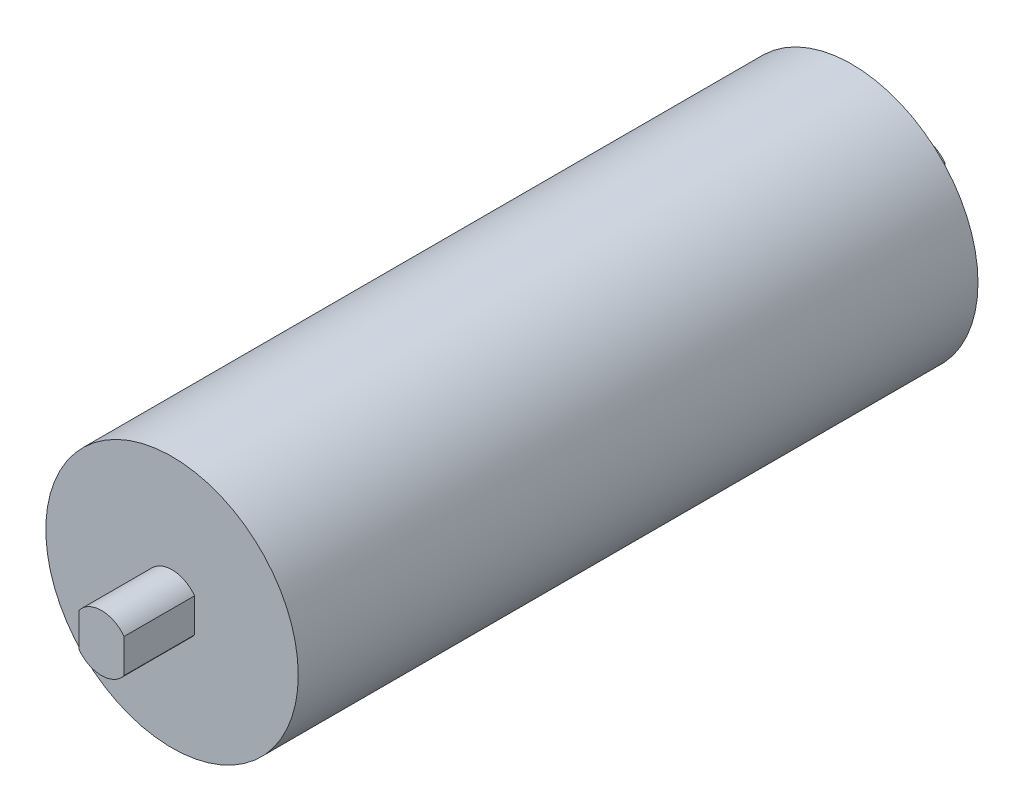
ISO-10303-21;
HEADER;
FILE_DESCRIPTION(('STEP AP214'),'2;1');
FILE_NAME('part.step','',(''),(''),'','','');
FILE_SCHEMA(('AUTOMOTIVE_DESIGN { 1 0 10303 214 1 1 1 1 }'));
ENDSEC;
DATA;
#1=APPLICATION_CONTEXT('core data for automotive mechanical design processes');
#2=APPLICATION_PROTOCOL_DEFINITION('international standard','automotive_design',2000,#1);
#3=PRODUCT_CONTEXT('',#1,'mechanical');
#4=PRODUCT('Part','Part','',(#3));
#5=PRODUCT_RELATED_PRODUCT_CATEGORY('part','',(#4));
#6=PRODUCT_DEFINITION_FORMATION('','',#4);
#7=PRODUCT_DEFINITION_CONTEXT('part definition',#1,'design');
#8=PRODUCT_DEFINITION('design','',#6,#7);
#9=PRODUCT_DEFINITION_SHAPE('','',#8);
#10=(LENGTH_UNIT() NAMED_UNIT(*) SI_UNIT(.MILLI.,.METRE.));
#11=(NAMED_UNIT(*) PLANE_ANGLE_UNIT() SI_UNIT($,.RADIAN.));
#12=(NAMED_UNIT(*) SI_UNIT($,.STERADIAN.) SOLID_ANGLE_UNIT());
#13=UNCERTAINTY_MEASURE_WITH_UNIT(LENGTH_MEASURE(1.E-05),#10,'distance_accuracy_value','');
#14=(GEOMETRIC_REPRESENTATION_CONTEXT(3) GLOBAL_UNCERTAINTY_ASSIGNED_CONTEXT((#13)) GLOBAL_UNIT_ASSIGNED_CONTEXT((#10,
#11,#12)) REPRESENTATION_CONTEXT('',''));
#15=CARTESIAN_POINT('',(0.,0.,0.));
#16=DIRECTION('',(0.,0.,1.));
#17=DIRECTION('',(1.,0.,0.));
#18=AXIS2_PLACEMENT_3D('',#15,#16,#17);
#19=CARTESIAN_POINT('',(0.,0.,-145.5));
#20=DIRECTION('',(0.,0.,1.));
#21=DIRECTION('',(1.,0.,0.));
#22=AXIS2_PLACEMENT_3D('',#19,#20,#21);
#23=CYLINDRICAL_SURFACE('',#22,10.);
#24=DIRECTION('',(0.,0.,-1.));
#25=VECTOR('',#24,1.);
#26=CARTESIAN_POINT('',(8.,6.,-120.5));
#27=LINE('',#26,#25);
#28=CARTESIAN_POINT('',(8.,6.,-120.5));
#29=VERTEX_POINT('',#28);
#30=CARTESIAN_POINT('',(8.,6.,-145.5));
#31=VERTEX_POINT('',#30);
#32=EDGE_CURVE('E54',#29,#31,#27,.T.);
#33=ORIENTED_EDGE('',*,*,#32,.T.);
#34=CARTESIAN_POINT('',(0.,0.,-145.5));
#35=DIRECTION('',(0.,0.,-1.));
#36=DIRECTION('',(-1.,0.,0.));
#37=AXIS2_PLACEMENT_3D('',#34,#35,#36);
#38=CIRCLE('',#37,10.);
#39=CARTESIAN_POINT('',(-8.,6.,-145.5));
#40=VERTEX_POINT('',#39);
#41=EDGE_CURVE('E117',#40,#31,#38,.T.);
#42=ORIENTED_EDGE('',*,*,#41,.F.);
#43=DIRECTION('',(0.,0.,-1.));
#44=VECTOR('',#43,1.);
#45=CARTESIAN_POINT('',(-8.,6.,-120.5));
#46=LINE('',#45,#44);
#47=CARTESIAN_POINT('',(-8.,6.,-120.5));
#48=VERTEX_POINT('',#47);
#49=EDGE_CURVE('E62',#48,#40,#46,.T.);
#50=ORIENTED_EDGE('',*,*,#49,.F.);
#51=CARTESIAN_POINT('',(0.,0.,-120.5));
#52=DIRECTION('',(0.,0.,1.));
#53=DIRECTION('',(1.,0.,0.));
#54=AXIS2_PLACEMENT_3D('',#51,#52,#53);
#55=CIRCLE('',#54,10.);
#56=EDGE_CURVE('E11',#48,#29,#55,.F.);
#57=ORIENTED_EDGE('',*,*,#56,.T.);
#58=EDGE_LOOP('',(#33,#42,#50,#57));
#59=FACE_BOUND('',#58,.T.);
#60=ADVANCED_FACE('F39',(#59),#23,.T.);
#61=DIRECTION('',(0.,0.,-1.));
#62=VECTOR('',#61,1.);
#63=CARTESIAN_POINT('',(8.,-6.,-120.5));
#64=LINE('',#63,#62);
#65=CARTESIAN_POINT('',(8.,-6.,-120.5));
#66=VERTEX_POINT('',#65);
#67=CARTESIAN_POINT('',(8.,-6.,-145.5));
#68=VERTEX_POINT('',#67);
#69=EDGE_CURVE('E103',#66,#68,#64,.T.);
#70=ORIENTED_EDGE('',*,*,#69,.F.);
#71=CARTESIAN_POINT('',(-8.,-6.,-120.5));
#72=VERTEX_POINT('',#71);
#73=EDGE_CURVE('E47',#66,#72,#55,.F.);
#74=ORIENTED_EDGE('',*,*,#73,.T.);
#75=DIRECTION('',(0.,0.,-1.));
#76=VECTOR('',#75,1.);
#77=CARTESIAN_POINT('',(-8.,-6.,-120.5));
#78=LINE('',#77,#76);
#79=CARTESIAN_POINT('',(-8.,-6.,-145.5));
#80=VERTEX_POINT('',#79);
#81=EDGE_CURVE('E122',#72,#80,#78,.T.);
#82=ORIENTED_EDGE('',*,*,#81,.T.);
#83=EDGE_CURVE('E115',#68,#80,#38,.T.);
#84=ORIENTED_EDGE('',*,*,#83,.F.);
#85=EDGE_LOOP('',(#70,#74,#82,#84));
#86=FACE_BOUND('',#85,.T.);
#87=ADVANCED_FACE('F120',(#86),#23,.T.);
#88=CARTESIAN_POINT('',(0.,0.,-145.5));
#89=DIRECTION('',(0.,0.,-1.));
#90=DIRECTION('',(-1.,0.,0.));
#91=AXIS2_PLACEMENT_3D('',#88,#89,#90);
#92=PLANE('',#91);
#93=ORIENTED_EDGE('',*,*,#41,.T.);
#94=DIRECTION('',(0.,-1.,0.));
#95=VECTOR('',#94,1.);
#96=CARTESIAN_POINT('',(8.,6.,-145.5));
#97=LINE('',#96,#95);
#98=EDGE_CURVE('E106',#31,#68,#97,.T.);
#99=ORIENTED_EDGE('',*,*,#98,.T.);
#100=ORIENTED_EDGE('',*,*,#83,.T.);
#101=DIRECTION('',(0.,1.,0.));
#102=VECTOR('',#101,1.);
#103=CARTESIAN_POINT('',(-8.,6.,-145.5));
#104=LINE('',#103,#102);
#105=EDGE_CURVE('E149',#80,#40,#104,.T.);
#106=ORIENTED_EDGE('',*,*,#105,.T.);
#107=EDGE_LOOP('',(#93,#99,#100,#106));
#108=FACE_BOUND('',#107,.T.);
#109=ADVANCED_FACE('F114',(#108),#92,.T.);
#110=CARTESIAN_POINT('',(0.,0.,145.5));
#111=DIRECTION('',(0.,0.,-1.));
#112=DIRECTION('',(-1.,0.,0.));
#113=AXIS2_PLACEMENT_3D('',#110,#111,#112);
#114=CYLINDRICAL_SURFACE('',#113,10.);
#115=CARTESIAN_POINT('',(0.,0.,145.5));
#116=DIRECTION('',(0.,0.,1.));
#117=DIRECTION('',(1.,0.,0.));
#118=AXIS2_PLACEMENT_3D('',#115,#116,#117);
#119=CIRCLE('',#118,10.);
#120=CARTESIAN_POINT('',(8.,6.,145.5));
#121=VERTEX_POINT('',#120);
#122=CARTESIAN_POINT('',(-8.,6.,145.5));
#123=VERTEX_POINT('',#122);
#124=EDGE_CURVE('E134',#121,#123,#119,.T.);
#125=ORIENTED_EDGE('',*,*,#124,.F.);
#126=DIRECTION('',(0.,0.,1.));
#127=VECTOR('',#126,1.);
#128=CARTESIAN_POINT('',(8.,6.,120.5));
#129=LINE('',#128,#127);
#130=CARTESIAN_POINT('',(8.,6.,120.5));
#131=VERTEX_POINT('',#130);
#132=EDGE_CURVE('E161',#131,#121,#129,.T.);
#133=ORIENTED_EDGE('',*,*,#132,.F.);
#134=CARTESIAN_POINT('',(0.,0.,120.5));
#135=DIRECTION('',(0.,0.,1.));
#136=DIRECTION('',(1.,0.,0.));
#137=AXIS2_PLACEMENT_3D('',#134,#135,#136);
#138=CIRCLE('',#137,10.);
#139=CARTESIAN_POINT('',(-8.,6.,120.5));
#140=VERTEX_POINT('',#139);
#141=EDGE_CURVE('E125',#131,#140,#138,.T.);
#142=ORIENTED_EDGE('',*,*,#141,.T.);
#143=DIRECTION('',(0.,0.,1.));
#144=VECTOR('',#143,1.);
#145=CARTESIAN_POINT('',(-8.,6.,120.5));
#146=LINE('',#145,#144);
#147=EDGE_CURVE('E123',#140,#123,#146,.T.);
#148=ORIENTED_EDGE('',*,*,#147,.T.);
#149=EDGE_LOOP('',(#125,#133,#142,#148));
#150=FACE_BOUND('',#149,.T.);
#151=ADVANCED_FACE('F191',(#150),#114,.T.);
#152=CARTESIAN_POINT('',(0.,0.,-120.5));
#153=DIRECTION('',(0.,0.,1.));
#154=DIRECTION('',(1.,0.,0.));
#155=AXIS2_PLACEMENT_3D('',#152,#153,#154);
#156=PLANE('',#155);
#157=CARTESIAN_POINT('',(0.,0.,-120.5));
#158=DIRECTION('',(0.,0.,1.));
#159=DIRECTION('',(1.,0.,0.));
#160=AXIS2_PLACEMENT_3D('',#157,#158,#159);
#161=CIRCLE('',#160,44.75);
#162=CARTESIAN_POINT('',(44.75,0.,-120.5));
#163=VERTEX_POINT('',#162);
#164=EDGE_CURVE('E138',#163,#163,#161,.T.);
#165=ORIENTED_EDGE('',*,*,#164,.F.);
#166=EDGE_LOOP('',(#165));
#167=FACE_BOUND('',#166,.T.);
#168=ORIENTED_EDGE('',*,*,#56,.F.);
#169=DIRECTION('',(0.,1.,0.));
#170=VECTOR('',#169,1.);
#171=CARTESIAN_POINT('',(-8.,6.,-120.5));
#172=LINE('',#171,#170);
#173=EDGE_CURVE('E147',#72,#48,#172,.T.);
#174=ORIENTED_EDGE('',*,*,#173,.F.);
#175=ORIENTED_EDGE('',*,*,#73,.F.);
#176=DIRECTION('',(0.,-1.,0.));
#177=VECTOR('',#176,1.);
#178=CARTESIAN_POINT('',(8.,6.,-120.5));
#179=LINE('',#178,#177);
#180=EDGE_CURVE('E107',#29,#66,#179,.T.);
#181=ORIENTED_EDGE('',*,*,#180,.F.);
#182=EDGE_LOOP('',(#168,#174,#175,#181));
#183=FACE_BOUND('',#182,.T.);
#184=ADVANCED_FACE('F148',(#167,#183),#156,.F.);
#185=CARTESIAN_POINT('',(0.,0.,120.5));
#186=DIRECTION('',(0.,0.,1.));
#187=DIRECTION('',(1.,0.,0.));
#188=AXIS2_PLACEMENT_3D('',#185,#186,#187);
#189=PLANE('',#188);
#190=CARTESIAN_POINT('',(0.,0.,120.5));
#191=DIRECTION('',(0.,0.,1.));
#192=DIRECTION('',(1.,0.,0.));
#193=AXIS2_PLACEMENT_3D('',#190,#191,#192);
#194=CIRCLE('',#193,44.75);
#195=CARTESIAN_POINT('',(44.75,0.,120.5));
#196=VERTEX_POINT('',#195);
#197=EDGE_CURVE('E140',#196,#196,#194,.T.);
#198=ORIENTED_EDGE('',*,*,#197,.T.);
#199=EDGE_LOOP('',(#198));
#200=FACE_BOUND('',#199,.T.);
#201=CARTESIAN_POINT('',(-8.,-6.,120.5));
#202=VERTEX_POINT('',#201);
#203=CARTESIAN_POINT('',(8.,-6.,120.5));
#204=VERTEX_POINT('',#203);
#205=EDGE_CURVE('E131',#202,#204,#138,.T.);
#206=ORIENTED_EDGE('',*,*,#205,.F.);
#207=DIRECTION('',(0.,1.,0.));
#208=VECTOR('',#207,1.);
#209=CARTESIAN_POINT('',(-8.,6.,120.5));
#210=LINE('',#209,#208);
#211=EDGE_CURVE('E169',#202,#140,#210,.T.);
#212=ORIENTED_EDGE('',*,*,#211,.T.);
#213=ORIENTED_EDGE('',*,*,#141,.F.);
#214=DIRECTION('',(0.,-1.,0.));
#215=VECTOR('',#214,1.);
#216=CARTESIAN_POINT('',(8.,6.,120.5));
#217=LINE('',#216,#215);
#218=EDGE_CURVE('E154',#131,#204,#217,.T.);
#219=ORIENTED_EDGE('',*,*,#218,.T.);
#220=EDGE_LOOP('',(#206,#212,#213,#219));
#221=FACE_BOUND('',#220,.T.);
#222=ADVANCED_FACE('F189',(#200,#221),#189,.T.);
#223=CARTESIAN_POINT('',(0.,0.,120.5));
#224=DIRECTION('',(0.,0.,-1.));
#225=DIRECTION('',(-1.,0.,0.));
#226=AXIS2_PLACEMENT_3D('',#223,#224,#225);
#227=CYLINDRICAL_SURFACE('',#226,44.75);
#228=ORIENTED_EDGE('',*,*,#197,.F.);
#229=EDGE_LOOP('',(#228));
#230=FACE_BOUND('',#229,.T.);
#231=ORIENTED_EDGE('',*,*,#164,.T.);
#232=EDGE_LOOP('',(#231));
#233=FACE_BOUND('',#232,.T.);
#234=ADVANCED_FACE('F41',(#230,#233),#227,.T.);
#235=ORIENTED_EDGE('',*,*,#205,.T.);
#236=DIRECTION('',(0.,0.,1.));
#237=VECTOR('',#236,1.);
#238=CARTESIAN_POINT('',(8.,-6.,120.5));
#239=LINE('',#238,#237);
#240=CARTESIAN_POINT('',(8.,-6.,145.5));
#241=VERTEX_POINT('',#240);
#242=EDGE_CURVE('E162',#204,#241,#239,.T.);
#243=ORIENTED_EDGE('',*,*,#242,.T.);
#244=CARTESIAN_POINT('',(-8.,-6.,145.5));
#245=VERTEX_POINT('',#244);
#246=EDGE_CURVE('E135',#245,#241,#119,.T.);
#247=ORIENTED_EDGE('',*,*,#246,.F.);
#248=DIRECTION('',(0.,0.,1.));
#249=VECTOR('',#248,1.);
#250=CARTESIAN_POINT('',(-8.,-6.,120.5));
#251=LINE('',#250,#249);
#252=EDGE_CURVE('E127',#202,#245,#251,.T.);
#253=ORIENTED_EDGE('',*,*,#252,.F.);
#254=EDGE_LOOP('',(#235,#243,#247,#253));
#255=FACE_BOUND('',#254,.T.);
#256=ADVANCED_FACE('F185',(#255),#114,.T.);
#257=CARTESIAN_POINT('',(0.,0.,145.5));
#258=DIRECTION('',(0.,0.,1.));
#259=DIRECTION('',(1.,0.,0.));
#260=AXIS2_PLACEMENT_3D('',#257,#258,#259);
#261=PLANE('',#260);
#262=DIRECTION('',(0.,-1.,0.));
#263=VECTOR('',#262,1.);
#264=CARTESIAN_POINT('',(8.,6.,145.5));
#265=LINE('',#264,#263);
#266=EDGE_CURVE('E152',#121,#241,#265,.T.);
#267=ORIENTED_EDGE('',*,*,#266,.F.);
#268=ORIENTED_EDGE('',*,*,#124,.T.);
#269=DIRECTION('',(0.,1.,0.));
#270=VECTOR('',#269,1.);
#271=CARTESIAN_POINT('',(-8.,6.,145.5));
#272=LINE('',#271,#270);
#273=EDGE_CURVE('E165',#245,#123,#272,.T.);
#274=ORIENTED_EDGE('',*,*,#273,.F.);
#275=ORIENTED_EDGE('',*,*,#246,.T.);
#276=EDGE_LOOP('',(#267,#268,#274,#275));
#277=FACE_BOUND('',#276,.T.);
#278=ADVANCED_FACE('F183',(#277),#261,.T.);
#279=CARTESIAN_POINT('',(-8.,6.,120.5));
#280=DIRECTION('',(1.,0.,0.));
#281=DIRECTION('',(0.,0.,-1.));
#282=AXIS2_PLACEMENT_3D('',#279,#280,#281);
#283=PLANE('',#282);
#284=ORIENTED_EDGE('',*,*,#273,.T.);
#285=ORIENTED_EDGE('',*,*,#147,.F.);
#286=ORIENTED_EDGE('',*,*,#211,.F.);
#287=ORIENTED_EDGE('',*,*,#252,.T.);
#288=EDGE_LOOP('',(#284,#285,#286,#287));
#289=FACE_BOUND('',#288,.T.);
#290=ADVANCED_FACE('F177',(#289),#283,.F.);
#291=CARTESIAN_POINT('',(8.,6.,120.5));
#292=DIRECTION('',(-1.,0.,0.));
#293=DIRECTION('',(0.,0.,1.));
#294=AXIS2_PLACEMENT_3D('',#291,#292,#293);
#295=PLANE('',#294);
#296=ORIENTED_EDGE('',*,*,#266,.T.);
#297=ORIENTED_EDGE('',*,*,#242,.F.);
#298=ORIENTED_EDGE('',*,*,#218,.F.);
#299=ORIENTED_EDGE('',*,*,#132,.T.);
#300=EDGE_LOOP('',(#296,#297,#298,#299));
#301=FACE_BOUND('',#300,.T.);
#302=ADVANCED_FACE('F187',(#301),#295,.F.);
#303=CARTESIAN_POINT('',(-8.,6.,-120.5));
#304=DIRECTION('',(-1.,0.,0.));
#305=DIRECTION('',(0.,0.,1.));
#306=AXIS2_PLACEMENT_3D('',#303,#304,#305);
#307=PLANE('',#306);
#308=ORIENTED_EDGE('',*,*,#105,.F.);
#309=ORIENTED_EDGE('',*,*,#81,.F.);
#310=ORIENTED_EDGE('',*,*,#173,.T.);
#311=ORIENTED_EDGE('',*,*,#49,.T.);
#312=EDGE_LOOP('',(#308,#309,#310,#311));
#313=FACE_BOUND('',#312,.T.);
#314=ADVANCED_FACE('F151',(#313),#307,.T.);
#315=CARTESIAN_POINT('',(8.,6.,-120.5));
#316=DIRECTION('',(1.,0.,0.));
#317=DIRECTION('',(0.,0.,-1.));
#318=AXIS2_PLACEMENT_3D('',#315,#316,#317);
#319=PLANE('',#318);
#320=ORIENTED_EDGE('',*,*,#98,.F.);
#321=ORIENTED_EDGE('',*,*,#32,.F.);
#322=ORIENTED_EDGE('',*,*,#180,.T.);
#323=ORIENTED_EDGE('',*,*,#69,.T.);
#324=EDGE_LOOP('',(#320,#321,#322,#323));
#325=FACE_BOUND('',#324,.T.);
#326=ADVANCED_FACE('F105',(#325),#319,.T.);
#327=CLOSED_SHELL('',(#60,#87,#109,#151,#184,#222,#234,#256,#278,#290,#302,#314,#326));
#328=MANIFOLD_SOLID_BREP('B2',#327);
#329=ADVANCED_BREP_SHAPE_REPRESENTATION('',(#18,#328),#14);
#330=SHAPE_DEFINITION_REPRESENTATION(#9,#329);
ENDSEC;
END-ISO-10303-21;
